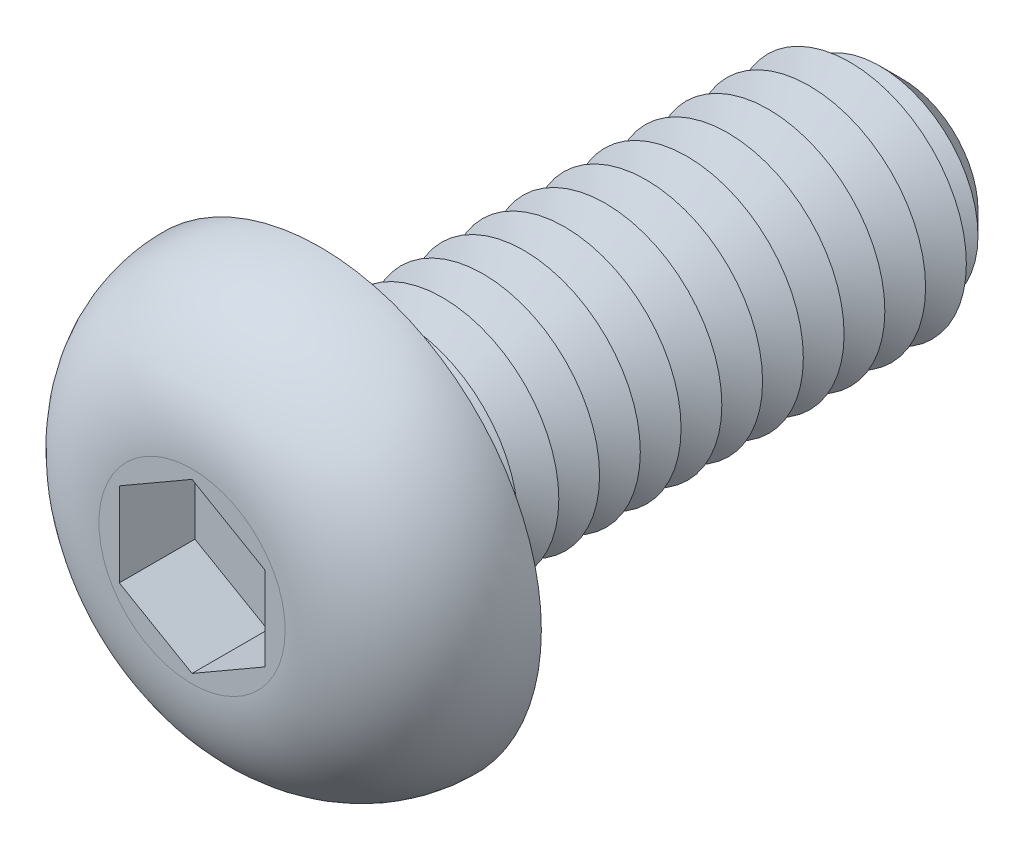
from build123d import *

# Parameters (mm, degrees)
CUT_EXTRUDE1_DEPTH  = 1.3
SKETCH4_R           = 2
BOSS_EXTRUDE1_DEPTH = 10
CHAMFER1_SIZE       = 0.7
LPATTERN1_COUNT     = 13
LPATTERN1_PITCH     = 0.7
FILLET2_R           = 0.35
SKETCH6_R           = 0.5
CUT_EXTRUDE2_DEPTH  = 10.9


with BuildPart() as part:
    # Sketch2 → Revolve1 (revolve)
    with BuildSketch(Plane(origin=(0, 0, 0), x_dir=(0, 0, -1), z_dir=(1, 0, 0)), mode=Mode.PRIVATE) as revolve1_sk:
        with BuildLine():
            Line((0, 0), (-2.2, 0))
            Line((-2.2, 0), (-2.2, 1.6))
            ThreePointArc((-2.2, 1.6), (-1.555634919, 3.155634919), (0, 3.8))
            Line((0, 3.8), (0, 0))
        make_face()
    revolve(revolve1_sk.sketch.rotate(Axis((0, 0, 47.934239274), (0, 0, -1)), 90), axis=Axis((0, 0, 47.934239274), (0, 0, -1)))

    # Sketch3 → Cut-Extrude1 (cut)
    with BuildSketch(Plane.XY.offset(2.2)):
        Polygon((0, 1.443375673), (-1.25, 0.721687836), (-1.25, -0.721687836), (0, -1.443375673), (1.25, -0.721687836), (1.25, 0.721687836), align=None)
    extrude(amount=-CUT_EXTRUDE1_DEPTH, mode=Mode.SUBTRACT)

    # Sketch4 → Boss-Extrude1 (add)
    with BuildSketch(Plane(origin=(0, 0, 0), x_dir=(-1, 0, 0), z_dir=(0, 0, -1))):
        with Locations(Location((0, 0, 0), (0, 0, 180))):
            Circle(SKETCH4_R)
    extrude(amount=BOSS_EXTRUDE1_DEPTH)

    # Chamfer1
    chamfer1_edges = [part.edges().sort_by_distance(p)[0] for p in [
        (-2, 0, -10),
    ]]
    chamfer(chamfer1_edges, length=CHAMFER1_SIZE)

    # Sketch5 → Cut-Revolve1 (revolve, cut)
    with BuildSketch(Plane(origin=(0, 0, 0), x_dir=(0, 0, -1), z_dir=(1, 0, 0)), mode=Mode.PRIVATE) as cut_revolve1_sk:
        Polygon((0.7, 2), (1.4, 2), (1.05, 1.393782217), align=None)
    cut_revolve1 = revolve(cut_revolve1_sk.sketch.rotate(Axis((0, 0, 47.934239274), (0, 0, -1)), 90), axis=Axis((0, 0, 47.934239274), (0, 0, -1)), mode=Mode.SUBTRACT)

    # LPattern1: Cut-Revolve1 ×13
    with Locations(*[(0, 0, -i * LPATTERN1_PITCH) for i in range(1, LPATTERN1_COUNT)]):
        add(cut_revolve1, mode=Mode.SUBTRACT)

    # Fillet2
    fillet2_edges = [part.edges().sort_by_distance(p)[0] for p in [
        (-2, 0, 0),
    ]]
    fillet(fillet2_edges, radius=FILLET2_R)

    # Sketch6 → Cut-Extrude2 (cut)
    with BuildSketch(Plane.XY.offset(0.9)):
        Circle(SKETCH6_R)
    extrude(amount=-CUT_EXTRUDE2_DEPTH, mode=Mode.SUBTRACT)


solid = part.part
